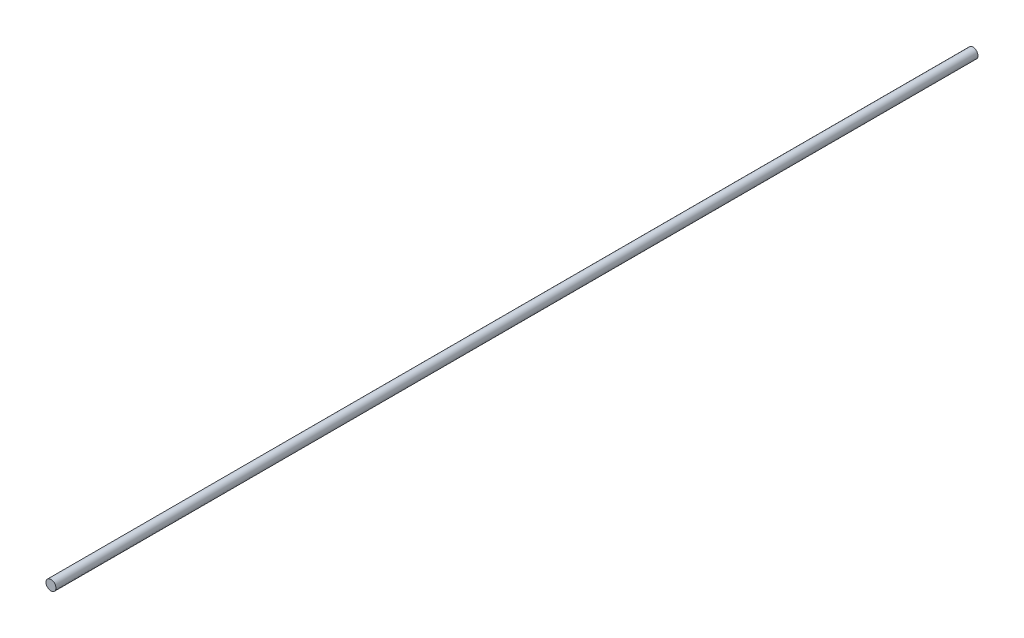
from build123d import *

# Parameters (mm, degrees)
SKETCH1_R           = 30
BOSS_EXTRUDE1_DEPTH = 5550


with BuildPart() as part:
    # Sketch1 → Boss-Extrude1 (new body)
    with BuildSketch(Plane.XY):
        Circle(SKETCH1_R)
    extrude(amount=-BOSS_EXTRUDE1_DEPTH)


solid = part.part
